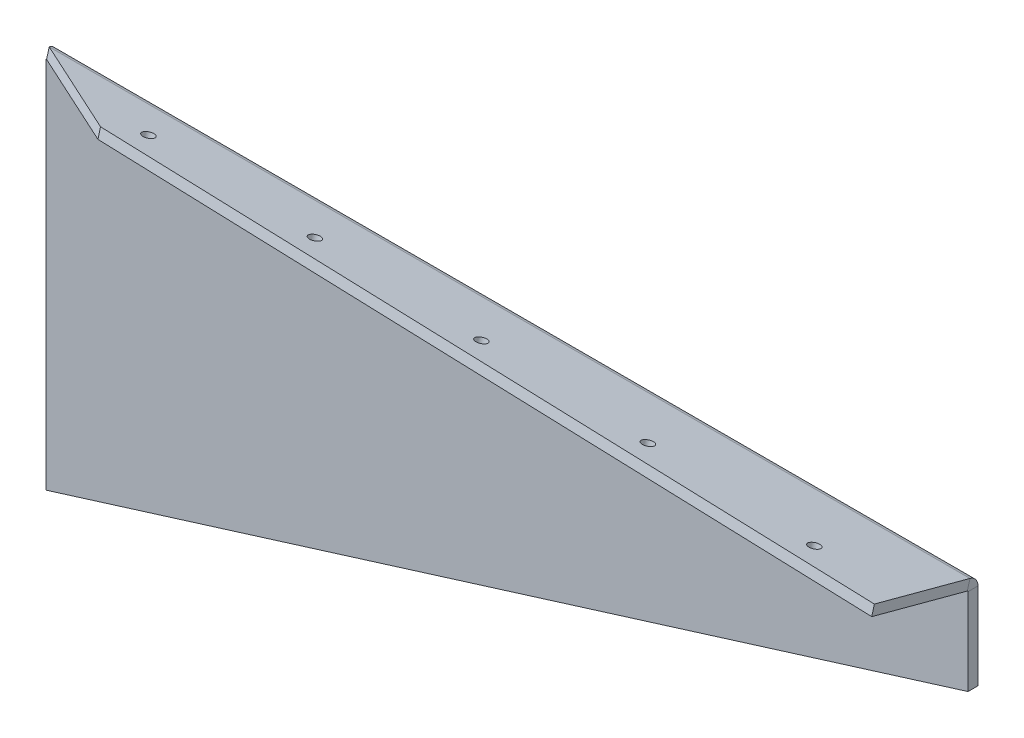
ISO-10303-21;
HEADER;
FILE_DESCRIPTION(('STEP AP214'),'2;1');
FILE_NAME('part.step','',(''),(''),'','','');
FILE_SCHEMA(('AUTOMOTIVE_DESIGN { 1 0 10303 214 1 1 1 1 }'));
ENDSEC;
DATA;
#1=APPLICATION_CONTEXT('core data for automotive mechanical design processes');
#2=APPLICATION_PROTOCOL_DEFINITION('international standard','automotive_design',2000,#1);
#3=PRODUCT_CONTEXT('',#1,'mechanical');
#4=PRODUCT('Part','Part','',(#3));
#5=PRODUCT_RELATED_PRODUCT_CATEGORY('part','',(#4));
#6=PRODUCT_DEFINITION_FORMATION('','',#4);
#7=PRODUCT_DEFINITION_CONTEXT('part definition',#1,'design');
#8=PRODUCT_DEFINITION('design','',#6,#7);
#9=PRODUCT_DEFINITION_SHAPE('','',#8);
#10=(LENGTH_UNIT() NAMED_UNIT(*) SI_UNIT(.MILLI.,.METRE.));
#11=(NAMED_UNIT(*) PLANE_ANGLE_UNIT() SI_UNIT($,.RADIAN.));
#12=(NAMED_UNIT(*) SI_UNIT($,.STERADIAN.) SOLID_ANGLE_UNIT());
#13=UNCERTAINTY_MEASURE_WITH_UNIT(LENGTH_MEASURE(1.E-05),#10,'distance_accuracy_value','');
#14=(GEOMETRIC_REPRESENTATION_CONTEXT(3) GLOBAL_UNCERTAINTY_ASSIGNED_CONTEXT((#13)) GLOBAL_UNIT_ASSIGNED_CONTEXT((#10,
#11,#12)) REPRESENTATION_CONTEXT('',''));
#15=CARTESIAN_POINT('',(0.,0.,0.));
#16=DIRECTION('',(0.,0.,1.));
#17=DIRECTION('',(1.,0.,0.));
#18=AXIS2_PLACEMENT_3D('',#15,#16,#17);
#19=CARTESIAN_POINT('',(0.,-300.,8.));
#20=DIRECTION('',(1.,0.,0.));
#21=DIRECTION('',(0.,0.,-1.));
#22=AXIS2_PLACEMENT_3D('',#19,#20,#21);
#23=PLANE('',#22);
#24=DIRECTION('',(0.,0.,-1.));
#25=VECTOR('',#24,1.);
#26=CARTESIAN_POINT('',(0.,-0.565213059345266,8.00000000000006));
#27=LINE('',#26,#25);
#28=CARTESIAN_POINT('',(0.,-0.565213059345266,8.00000000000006));
#29=VERTEX_POINT('',#28);
#30=CARTESIAN_POINT('',(0.,-0.565213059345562,0.));
#31=VERTEX_POINT('',#30);
#32=EDGE_CURVE('E144',#29,#31,#27,.T.);
#33=ORIENTED_EDGE('',*,*,#32,.T.);
#34=DIRECTION('',(0.,-1.,0.));
#35=VECTOR('',#34,1.);
#36=CARTESIAN_POINT('',(0.,-300.,0.));
#37=LINE('',#36,#35);
#38=CARTESIAN_POINT('',(0.,-300.,0.));
#39=VERTEX_POINT('',#38);
#40=EDGE_CURVE('E149',#31,#39,#37,.T.);
#41=ORIENTED_EDGE('',*,*,#40,.T.);
#42=DIRECTION('',(0.,0.,-1.));
#43=VECTOR('',#42,1.);
#44=CARTESIAN_POINT('',(0.,-300.,8.));
#45=LINE('',#44,#43);
#46=CARTESIAN_POINT('',(0.,-300.,8.));
#47=VERTEX_POINT('',#46);
#48=EDGE_CURVE('E11',#47,#39,#45,.T.);
#49=ORIENTED_EDGE('',*,*,#48,.F.);
#50=DIRECTION('',(0.,-1.,0.));
#51=VECTOR('',#50,1.);
#52=CARTESIAN_POINT('',(0.,-300.,8.));
#53=LINE('',#52,#51);
#54=EDGE_CURVE('E195',#29,#47,#53,.T.);
#55=ORIENTED_EDGE('',*,*,#54,.F.);
#56=EDGE_LOOP('',(#33,#41,#49,#55));
#57=FACE_BOUND('',#56,.T.);
#58=ADVANCED_FACE('F31',(#57),#23,.F.);
#59=CARTESIAN_POINT('',(740.,0.,8.));
#60=DIRECTION('',(-1.,0.,0.));
#61=DIRECTION('',(0.,0.,1.));
#62=AXIS2_PLACEMENT_3D('',#59,#60,#61);
#63=PLANE('',#62);
#64=DIRECTION('',(0.,0.,-1.));
#65=VECTOR('',#64,1.);
#66=CARTESIAN_POINT('',(740.,-0.565213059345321,8.00000000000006));
#67=LINE('',#66,#65);
#68=CARTESIAN_POINT('',(740.,-0.565213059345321,8.00000000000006));
#69=VERTEX_POINT('',#68);
#70=CARTESIAN_POINT('',(740.,-0.565213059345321,0.));
#71=VERTEX_POINT('',#70);
#72=EDGE_CURVE('E147',#69,#71,#67,.T.);
#73=ORIENTED_EDGE('',*,*,#72,.F.);
#74=DIRECTION('',(0.,1.,0.));
#75=VECTOR('',#74,1.);
#76=CARTESIAN_POINT('',(740.,0.,8.));
#77=LINE('',#76,#75);
#78=CARTESIAN_POINT('',(740.,-70.,8.));
#79=VERTEX_POINT('',#78);
#80=EDGE_CURVE('E206',#79,#69,#77,.T.);
#81=ORIENTED_EDGE('',*,*,#80,.F.);
#82=DIRECTION('',(0.,0.,-1.));
#83=VECTOR('',#82,1.);
#84=CARTESIAN_POINT('',(740.,-70.,8.));
#85=LINE('',#84,#83);
#86=CARTESIAN_POINT('',(740.,-70.,0.));
#87=VERTEX_POINT('',#86);
#88=EDGE_CURVE('E38',#79,#87,#85,.T.);
#89=ORIENTED_EDGE('',*,*,#88,.T.);
#90=DIRECTION('',(0.,1.,0.));
#91=VECTOR('',#90,1.);
#92=CARTESIAN_POINT('',(740.,0.,0.));
#93=LINE('',#92,#91);
#94=EDGE_CURVE('E200',#87,#71,#93,.T.);
#95=ORIENTED_EDGE('',*,*,#94,.T.);
#96=EDGE_LOOP('',(#73,#81,#89,#95));
#97=FACE_BOUND('',#96,.T.);
#98=ADVANCED_FACE('F183',(#97),#63,.F.);
#99=CARTESIAN_POINT('',(0.,0.,8.));
#100=DIRECTION('',(0.,0.,-1.));
#101=DIRECTION('',(-1.,0.,0.));
#102=AXIS2_PLACEMENT_3D('',#99,#100,#101);
#103=PLANE('',#102);
#104=DIRECTION('',(-1.,0.,0.));
#105=VECTOR('',#104,1.);
#106=CARTESIAN_POINT('',(0.,-0.565213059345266,8.00000000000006));
#107=LINE('',#106,#105);
#108=EDGE_CURVE('E142',#29,#69,#107,.F.);
#109=ORIENTED_EDGE('',*,*,#108,.F.);
#110=ORIENTED_EDGE('',*,*,#54,.T.);
#111=DIRECTION('',(0.954938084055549,0.296805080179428,0.));
#112=VECTOR('',#111,1.);
#113=CARTESIAN_POINT('',(740.,-70.,8.));
#114=LINE('',#113,#112);
#115=EDGE_CURVE('E53',#47,#79,#114,.T.);
#116=ORIENTED_EDGE('',*,*,#115,.T.);
#117=ORIENTED_EDGE('',*,*,#80,.T.);
#118=EDGE_LOOP('',(#109,#110,#116,#117));
#119=FACE_BOUND('',#118,.T.);
#120=ADVANCED_FACE('F188',(#119),#103,.F.);
#121=CARTESIAN_POINT('',(0.,0.,0.));
#122=DIRECTION('',(0.,0.,-1.));
#123=DIRECTION('',(-1.,0.,0.));
#124=AXIS2_PLACEMENT_3D('',#121,#122,#123);
#125=PLANE('',#124);
#126=ORIENTED_EDGE('',*,*,#40,.F.);
#127=DIRECTION('',(-1.,0.,0.));
#128=VECTOR('',#127,1.);
#129=CARTESIAN_POINT('',(0.,-0.565213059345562,0.));
#130=LINE('',#129,#128);
#131=EDGE_CURVE('E100',#31,#71,#130,.F.);
#132=ORIENTED_EDGE('',*,*,#131,.T.);
#133=ORIENTED_EDGE('',*,*,#94,.F.);
#134=DIRECTION('',(0.954938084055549,0.296805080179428,0.));
#135=VECTOR('',#134,1.);
#136=CARTESIAN_POINT('',(740.,-70.,0.));
#137=LINE('',#136,#135);
#138=EDGE_CURVE('E199',#39,#87,#137,.T.);
#139=ORIENTED_EDGE('',*,*,#138,.F.);
#140=EDGE_LOOP('',(#126,#132,#133,#139));
#141=FACE_BOUND('',#140,.T.);
#142=ADVANCED_FACE('F180',(#141),#125,.T.);
#143=CARTESIAN_POINT('',(740.,-70.,8.));
#144=DIRECTION('',(-0.296805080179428,0.95493808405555,0.));
#145=DIRECTION('',(-0.95493808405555,-0.296805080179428,0.));
#146=AXIS2_PLACEMENT_3D('',#143,#144,#145);
#147=PLANE('',#146);
#148=ORIENTED_EDGE('',*,*,#138,.T.);
#149=ORIENTED_EDGE('',*,*,#88,.F.);
#150=ORIENTED_EDGE('',*,*,#115,.F.);
#151=ORIENTED_EDGE('',*,*,#48,.T.);
#152=EDGE_LOOP('',(#148,#149,#150,#151));
#153=FACE_BOUND('',#152,.T.);
#154=ADVANCED_FACE('F173',(#153),#147,.F.);
#155=CARTESIAN_POINT('',(740.,-0.565213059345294,8.73660000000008));
#156=DIRECTION('',(1.,0.,0.));
#157=DIRECTION('',(0.,1.,0.));
#158=AXIS2_PLACEMENT_3D('',#155,#156,#157);
#159=PLANE('',#158);
#160=DIRECTION('',(0.,0.965925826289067,-0.258819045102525));
#161=VECTOR('',#160,1.);
#162=CARTESIAN_POINT('',(740.,0.146287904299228,8.54595389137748));
#163=LINE('',#162,#161);
#164=CARTESIAN_POINT('',(740.,0.146287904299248,8.54595389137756));
#165=VERTEX_POINT('',#164);
#166=CARTESIAN_POINT('',(740.,7.87369451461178,6.47540153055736));
#167=VERTEX_POINT('',#166);
#168=EDGE_CURVE('E215',#165,#167,#163,.T.);
#169=ORIENTED_EDGE('',*,*,#168,.F.);
#170=CARTESIAN_POINT('',(740.,-0.565213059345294,8.73660000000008));
#171=DIRECTION('',(-1.,0.,0.));
#172=DIRECTION('',(0.,-1.,0.));
#173=AXIS2_PLACEMENT_3D('',#170,#171,#172);
#174=CIRCLE('',#173,0.736600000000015);
#175=EDGE_CURVE('E103',#69,#165,#174,.F.);
#176=ORIENTED_EDGE('',*,*,#175,.F.);
#177=ORIENTED_EDGE('',*,*,#72,.T.);
#178=CARTESIAN_POINT('',(740.,-0.565213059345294,8.73660000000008));
#179=DIRECTION('',(-1.,0.,0.));
#180=DIRECTION('',(0.,-1.,0.));
#181=AXIS2_PLACEMENT_3D('',#178,#179,#180);
#182=CIRCLE('',#181,8.73660000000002);
#183=EDGE_CURVE('E45',#71,#167,#182,.F.);
#184=ORIENTED_EDGE('',*,*,#183,.T.);
#185=EDGE_LOOP('',(#169,#176,#177,#184));
#186=FACE_BOUND('',#185,.T.);
#187=ADVANCED_FACE('F169',(#186),#159,.T.);
#188=CARTESIAN_POINT('',(1.01738350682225,7.95096858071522,6.45469600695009));
#189=CARTESIAN_POINT('',(0.847588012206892,7.45245769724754,4.59422806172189));
#190=CARTESIAN_POINT('',(0.678255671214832,6.32799520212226,2.91286364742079));
#191=CARTESIAN_POINT('',(0.339127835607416,3.27599070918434,0.570978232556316));
#192=CARTESIAN_POINT('',(0.169795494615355,1.36088508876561,-0.080000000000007));
#193=CARTESIAN_POINT('',(0.,-0.565213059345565,-0.0799999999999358));
#194=CARTESIAN_POINT('',(1.01738350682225,7.87369451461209,6.47540153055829));
#195=CARTESIAN_POINT('',(0.847589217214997,7.37970730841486,4.63181617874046));
#196=CARTESIAN_POINT('',(0.678255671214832,6.26544765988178,2.96570702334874));
#197=CARTESIAN_POINT('',(0.339127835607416,3.24113642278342,0.645071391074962));
#198=CARTESIAN_POINT('',(0.16979428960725,1.34340694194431,0.));
#199=CARTESIAN_POINT('',(0.,-0.565213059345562,0.));
#200=CARTESIAN_POINT('',(1.01738350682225,0.146287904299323,8.54595389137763));
#201=CARTESIAN_POINT('',(0.847709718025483,0.104668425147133,8.39062788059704));
#202=CARTESIAN_POINT('',(0.678255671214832,0.0106934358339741,8.25004461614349));
#203=CARTESIAN_POINT('',(0.339127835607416,-0.244292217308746,8.05438724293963));
#204=CARTESIAN_POINT('',(0.169673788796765,-0.404407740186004,8.00000000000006));
#205=CARTESIAN_POINT('',(0.,-0.565213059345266,8.00000000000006));
#206=CARTESIAN_POINT('',(1.01738350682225,0.0682410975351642,8.56686647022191));
#207=CARTESIAN_POINT('',(0.847710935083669,0.031190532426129,8.42859187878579));
#208=CARTESIAN_POINT('',(0.678255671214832,-0.0524795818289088,8.30341642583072));
#209=CARTESIAN_POINT('',(0.339127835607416,-0.279495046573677,8.12922133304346));
#210=CARTESIAN_POINT('',(0.169672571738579,-0.42206066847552,8.08080000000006));
#211=CARTESIAN_POINT('',(0.,-0.565213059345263,8.08080000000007));
#212=B_SPLINE_SURFACE_WITH_KNOTS('',1,3,((#188,#189,#190,#191,#192,#193),(#194,#195,#196,#197,
#198,#199),(#200,#201,#202,#203,#204,#205),(#206,#207,#208,#209,#210,#211)),.UNSPECIFIED.,.F.,
.F.,.F.,(2,1,1,2),(4,2,4),(-0.01,0.,1.,1.0101),(0.,0.5,1.),.UNSPECIFIED.);
#213=CARTESIAN_POINT('',(1.01738350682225,0.146287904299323,8.54595389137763));
#214=CARTESIAN_POINT('',(0.985529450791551,0.138484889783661,8.51679799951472));
#215=CARTESIAN_POINT('',(0.953676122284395,0.128873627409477,8.48812956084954));
#216=CARTESIAN_POINT('',(0.889975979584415,0.106215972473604,8.43218250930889));
#217=CARTESIAN_POINT('',(0.858129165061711,0.0931698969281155,8.40490376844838));
#218=CARTESIAN_POINT('',(0.794500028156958,0.0638495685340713,8.3521942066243));
#219=CARTESIAN_POINT('',(0.76271769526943,0.047581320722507,8.32676006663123));
#220=CARTESIAN_POINT('',(0.69915845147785,0.0120652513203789,8.27808215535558));
#221=CARTESIAN_POINT('',(0.667381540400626,-0.00718244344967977,8.25483829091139));
#222=CARTESIAN_POINT('',(0.571839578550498,-0.0691121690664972,8.18878319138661));
#223=CARTESIAN_POINT('',(0.50801830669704,-0.115906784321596,8.14978055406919));
#224=CARTESIAN_POINT('',(0.380468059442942,-0.217557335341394,8.08439974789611));
#225=CARTESIAN_POINT('',(0.316739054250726,-0.272405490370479,8.05800949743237));
#226=CARTESIAN_POINT('',(0.210869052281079,-0.367490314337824,8.02590586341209));
#227=CARTESIAN_POINT('',(0.168706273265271,-0.406405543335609,8.01621938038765));
#228=CARTESIAN_POINT('',(0.0843707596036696,-0.485281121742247,8.00325378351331));
#229=CARTESIAN_POINT('',(0.0421980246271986,-0.525241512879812,7.99997492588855));
#230=CARTESIAN_POINT('',(0.,-0.565213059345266,8.00000000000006));
#231=B_SPLINE_CURVE_WITH_KNOTS('',3,(#213,#214,#215,#216,#217,#218,#219,#220,#221,#222,#223,
#224,#225,#226,#227,#228,#229,#230),.UNSPECIFIED.,.F.,.F.,(4,2,2,2,2,2,2,2,4),(0.,
0.131602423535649,0.263192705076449,0.394540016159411,0.525881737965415,0.789206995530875,
1.05227950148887,1.22650322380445,1.4007339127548),.UNSPECIFIED.);
#232=CARTESIAN_POINT('',(1.01738350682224,0.146287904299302,8.54595389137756));
#233=VERTEX_POINT('',#232);
#234=EDGE_CURVE('E110',#233,#29,#231,.T.);
#235=DIRECTION('',(0.,0.965925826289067,-0.258819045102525));
#236=VECTOR('',#235,1.);
#237=CARTESIAN_POINT('',(1.01738350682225,0.146287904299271,8.54595389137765));
#238=LINE('',#237,#236);
#239=CARTESIAN_POINT('',(1.01738350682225,7.87369451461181,6.47540153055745));
#240=VERTEX_POINT('',#239);
#241=EDGE_CURVE('E107',#233,#240,#238,.T.);
#242=CARTESIAN_POINT('',(1.01738350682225,7.87369451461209,6.47540153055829));
#243=CARTESIAN_POINT('',(0.995436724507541,7.80987577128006,6.23712327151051));
#244=CARTESIAN_POINT('',(0.973485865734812,7.73591614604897,6.00156665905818));
#245=CARTESIAN_POINT('',(0.929585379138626,7.56836020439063,5.53755607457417));
#246=CARTESIAN_POINT('',(0.907635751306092,7.47476481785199,5.30910176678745));
#247=CARTESIAN_POINT('',(0.863755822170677,7.2686269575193,4.86104245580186));
#248=CARTESIAN_POINT('',(0.841825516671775,7.15609382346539,4.6414331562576));
#249=CARTESIAN_POINT('',(0.797970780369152,6.91286392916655,4.2125181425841));
#250=CARTESIAN_POINT('',(0.776046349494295,6.78216739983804,4.00321229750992));
#251=CARTESIAN_POINT('',(0.732187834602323,6.50348595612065,3.59631711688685));
#252=CARTESIAN_POINT('',(0.710253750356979,6.35549388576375,3.39873268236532));
#253=CARTESIAN_POINT('',(0.666379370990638,6.04332448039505,3.01678845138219));
#254=CARTESIAN_POINT('',(0.644439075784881,5.87914691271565,2.83242884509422));
#255=CARTESIAN_POINT('',(0.600556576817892,5.5358389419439,2.47831430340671));
#256=CARTESIAN_POINT('',(0.57861437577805,5.35671321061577,2.30855483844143));
#257=CARTESIAN_POINT('',(0.534736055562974,4.98474917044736,1.98479339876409));
#258=CARTESIAN_POINT('',(0.512799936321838,4.79191101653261,1.8307912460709));
#259=CARTESIAN_POINT('',(0.468925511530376,4.39393367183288,1.5396687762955));
#260=CARTESIAN_POINT('',(0.44698720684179,4.1887963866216,1.40254585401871));
#261=CARTESIAN_POINT('',(0.403105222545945,3.7675682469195,1.14607870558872));
#262=CARTESIAN_POINT('',(0.381161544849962,3.55147259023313,1.02674236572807));
#263=CARTESIAN_POINT('',(0.337278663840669,3.10992751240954,0.806759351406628));
#264=CARTESIAN_POINT('',(0.315339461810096,2.88447659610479,0.706115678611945));
#265=CARTESIAN_POINT('',(0.271474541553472,2.42597302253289,0.524306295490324));
#266=CARTESIAN_POINT('',(0.249548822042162,2.19292419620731,0.443130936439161));
#267=CARTESIAN_POINT('',(0.208654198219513,1.75266352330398,0.31038295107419));
#268=CARTESIAN_POINT('',(0.189685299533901,1.54620573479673,0.256294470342));
#269=CARTESIAN_POINT('',(0.151743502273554,1.12990112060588,0.163371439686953));
#270=CARTESIAN_POINT('',(0.132770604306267,0.920054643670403,0.124535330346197));
#271=CARTESIAN_POINT('',(0.094831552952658,0.498221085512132,0.0623453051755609));
#272=CARTESIAN_POINT('',(0.0758654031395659,0.286235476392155,0.0389813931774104));
#273=CARTESIAN_POINT('',(0.0379316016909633,-0.138903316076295,0.00780038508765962));
#274=CARTESIAN_POINT('',(0.0189639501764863,-0.352056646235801,-1.47089662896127E-05));
#275=CARTESIAN_POINT('',(0.,-0.565213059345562,0.));
#276=B_SPLINE_CURVE_WITH_KNOTS('',3,(#242,#243,#244,#245,#246,#247,#248,#249,#250,#251,#252,
#253,#254,#255,#256,#257,#258,#259,#260,#261,#262,#263,#264,#265,#266,#267,#268,#269,#270,#271,
#272,#273,#274,#275),.UNSPECIFIED.,.F.,.F.,(4,2,2,2,2,2,2,2,2,2,2,2,2,2,2,2,4),(0.,
0.74272618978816,1.48541721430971,2.22774302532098,2.97005939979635,3.71268399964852,
4.45531927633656,5.19772331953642,5.94011897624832,6.68239990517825,7.42500897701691,
8.16773719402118,8.91009654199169,9.55234285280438,10.1945234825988,10.8362888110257,
11.4781367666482),.UNSPECIFIED.);
#277=EDGE_CURVE('E94',#240,#31,#276,.T.);
#278=ORIENTED_EDGE('',*,*,#234,.F.);
#279=ORIENTED_EDGE('',*,*,#241,.T.);
#280=ORIENTED_EDGE('',*,*,#277,.T.);
#281=ORIENTED_EDGE('',*,*,#32,.F.);
#282=EDGE_LOOP('',(#278,#279,#280,#281));
#283=FACE_BOUND('',#282,.T.);
#284=ADVANCED_FACE('F108',(#283),#212,.F.);
#285=CARTESIAN_POINT('',(0.,-0.565213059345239,8.73660000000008));
#286=DIRECTION('',(-1.,0.,0.));
#287=DIRECTION('',(0.,0.965925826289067,-0.258819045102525));
#288=AXIS2_PLACEMENT_3D('',#285,#286,#287);
#289=CYLINDRICAL_SURFACE('',#288,8.73660000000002);
#290=ORIENTED_EDGE('',*,*,#131,.F.);
#291=ORIENTED_EDGE('',*,*,#277,.F.);
#292=DIRECTION('',(1.,0.,0.));
#293=VECTOR('',#292,1.);
#294=CARTESIAN_POINT('',(740.,7.87369451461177,6.47540153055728));
#295=LINE('',#294,#293);
#296=EDGE_CURVE('E98',#240,#167,#295,.T.);
#297=ORIENTED_EDGE('',*,*,#296,.T.);
#298=ORIENTED_EDGE('',*,*,#183,.F.);
#299=EDGE_LOOP('',(#290,#291,#297,#298));
#300=FACE_BOUND('',#299,.T.);
#301=ADVANCED_FACE('F96',(#300),#289,.T.);
#302=CARTESIAN_POINT('',(0.,-0.565213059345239,8.73660000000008));
#303=DIRECTION('',(-1.,0.,0.));
#304=DIRECTION('',(0.,0.965925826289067,-0.258819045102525));
#305=AXIS2_PLACEMENT_3D('',#302,#303,#304);
#306=CYLINDRICAL_SURFACE('',#305,0.736600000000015);
#307=ORIENTED_EDGE('',*,*,#108,.T.);
#308=ORIENTED_EDGE('',*,*,#175,.T.);
#309=DIRECTION('',(-1.,0.,0.));
#310=VECTOR('',#309,1.);
#311=CARTESIAN_POINT('',(740.,0.146287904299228,8.54595389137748));
#312=LINE('',#311,#310);
#313=EDGE_CURVE('E114',#165,#233,#312,.T.);
#314=ORIENTED_EDGE('',*,*,#313,.T.);
#315=ORIENTED_EDGE('',*,*,#234,.T.);
#316=EDGE_LOOP('',(#307,#308,#314,#315));
#317=FACE_BOUND('',#316,.T.);
#318=ADVANCED_FACE('F168',(#317),#306,.F.);
#319=CARTESIAN_POINT('',(740.,7.72740661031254,5.9294476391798));
#320=DIRECTION('',(-1.,0.,0.));
#321=DIRECTION('',(0.,0.,1.));
#322=AXIS2_PLACEMENT_3D('',#319,#320,#321);
#323=PLANE('',#322);
#324=ORIENTED_EDGE('',*,*,#168,.T.);
#325=DIRECTION('',(0.,-0.258819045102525,-0.965925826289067));
#326=VECTOR('',#325,1.);
#327=CARTESIAN_POINT('',(740.,7.72740661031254,5.9294476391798));
#328=LINE('',#327,#326);
#329=CARTESIAN_POINT('',(740.,28.4329302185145,83.2035137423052));
#330=VERTEX_POINT('',#329);
#331=EDGE_CURVE('E122',#330,#167,#328,.T.);
#332=ORIENTED_EDGE('',*,*,#331,.F.);
#333=DIRECTION('',(0.,-0.965925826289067,0.258819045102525));
#334=VECTOR('',#333,1.);
#335=CARTESIAN_POINT('',(740.,28.4329302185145,83.2035137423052));
#336=LINE('',#335,#334);
#337=CARTESIAN_POINT('',(740.,20.705523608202,85.2740661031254));
#338=VERTEX_POINT('',#337);
#339=EDGE_CURVE('E131',#330,#338,#336,.T.);
#340=ORIENTED_EDGE('',*,*,#339,.T.);
#341=DIRECTION('',(0.,-0.258819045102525,-0.965925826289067));
#342=VECTOR('',#341,1.);
#343=CARTESIAN_POINT('',(740.,0.,8.));
#344=LINE('',#343,#342);
#345=EDGE_CURVE('E123',#338,#165,#344,.T.);
#346=ORIENTED_EDGE('',*,*,#345,.T.);
#347=EDGE_LOOP('',(#324,#332,#340,#346));
#348=FACE_BOUND('',#347,.T.);
#349=ADVANCED_FACE('F233',(#348),#323,.F.);
#350=CARTESIAN_POINT('',(90.,20.6683588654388,54.2257389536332));
#351=DIRECTION('',(0.485642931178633,-0.2262485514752,-0.844371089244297));
#352=DIRECTION('',(-0.866848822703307,0.,-0.498571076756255));
#353=AXIS2_PLACEMENT_3D('',#350,#351,#352);
#354=PLANE('',#353);
#355=ORIENTED_EDGE('',*,*,#241,.F.);
#356=DIRECTION('',(0.874157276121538,0.125693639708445,0.469095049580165));
#357=VECTOR('',#356,1.);
#358=CARTESIAN_POINT('',(90.,12.9409522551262,56.2962913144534));
#359=LINE('',#358,#357);
#360=CARTESIAN_POINT('',(90.,12.9409522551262,56.2962913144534));
#361=VERTEX_POINT('',#360);
#362=EDGE_CURVE('E226',#233,#361,#359,.T.);
#363=ORIENTED_EDGE('',*,*,#362,.T.);
#364=DIRECTION('',(0.,-0.965925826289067,0.258819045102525));
#365=VECTOR('',#364,1.);
#366=CARTESIAN_POINT('',(90.,20.6683588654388,54.2257389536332));
#367=LINE('',#366,#365);
#368=CARTESIAN_POINT('',(90.,20.6683588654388,54.2257389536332));
#369=VERTEX_POINT('',#368);
#370=EDGE_CURVE('E127',#369,#361,#367,.T.);
#371=ORIENTED_EDGE('',*,*,#370,.F.);
#372=DIRECTION('',(0.874157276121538,0.125693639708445,0.469095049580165));
#373=VECTOR('',#372,1.);
#374=CARTESIAN_POINT('',(90.,20.6683588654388,54.2257389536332));
#375=LINE('',#374,#373);
#376=EDGE_CURVE('E119',#240,#369,#375,.T.);
#377=ORIENTED_EDGE('',*,*,#376,.F.);
#378=EDGE_LOOP('',(#355,#363,#371,#377));
#379=FACE_BOUND('',#378,.T.);
#380=ADVANCED_FACE('F125',(#379),#354,.F.);
#381=CARTESIAN_POINT('',(740.,7.72740661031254,5.9294476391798));
#382=DIRECTION('',(0.,-0.965925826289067,0.258819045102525));
#383=DIRECTION('',(0.,-0.258819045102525,-0.965925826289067));
#384=AXIS2_PLACEMENT_3D('',#381,#382,#383);
#385=PLANE('',#384);
#386=CARTESIAN_POINT('',(669.404501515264,22.4077408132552,60.7172007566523));
#387=DIRECTION('',(0.,-0.965925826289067,0.258819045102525));
#388=DIRECTION('',(0.,-0.258819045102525,-0.965925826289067));
#389=AXIS2_PLACEMENT_3D('',#386,#387,#388);
#390=CIRCLE('',#389,4.50000000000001);
#391=CARTESIAN_POINT('',(669.404501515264,21.2430551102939,56.3705345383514));
#392=VERTEX_POINT('',#391);
#393=EDGE_CURVE('E382',#392,#392,#390,.T.);
#394=ORIENTED_EDGE('',*,*,#393,.T.);
#395=EDGE_LOOP('',(#394));
#396=FACE_BOUND('',#395,.T.);
#397=CARTESIAN_POINT('',(529.553376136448,20.7371499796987,54.4824708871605));
#398=DIRECTION('',(0.,-0.965925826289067,0.258819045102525));
#399=DIRECTION('',(0.,-0.258819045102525,-0.965925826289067));
#400=AXIS2_PLACEMENT_3D('',#397,#398,#399);
#401=CIRCLE('',#400,4.50000000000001);
#402=CARTESIAN_POINT('',(529.553376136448,19.5724642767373,50.1358046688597));
#403=VERTEX_POINT('',#402);
#404=EDGE_CURVE('E386',#403,#403,#401,.T.);
#405=ORIENTED_EDGE('',*,*,#404,.T.);
#406=EDGE_LOOP('',(#405));
#407=FACE_BOUND('',#406,.T.);
#408=CARTESIAN_POINT('',(389.702250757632,19.0665591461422,48.2477410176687));
#409=DIRECTION('',(0.,-0.965925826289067,0.258819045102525));
#410=DIRECTION('',(0.,-0.258819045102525,-0.965925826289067));
#411=AXIS2_PLACEMENT_3D('',#408,#409,#410);
#412=CIRCLE('',#411,4.50000000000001);
#413=CARTESIAN_POINT('',(389.702250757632,17.9018734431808,43.9010747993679));
#414=VERTEX_POINT('',#413);
#415=EDGE_CURVE('E395',#414,#414,#412,.T.);
#416=ORIENTED_EDGE('',*,*,#415,.T.);
#417=EDGE_LOOP('',(#416));
#418=FACE_BOUND('',#417,.T.);
#419=CARTESIAN_POINT('',(249.851125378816,17.3959683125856,42.0130111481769));
#420=DIRECTION('',(0.,-0.965925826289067,0.258819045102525));
#421=DIRECTION('',(0.,-0.258819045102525,-0.965925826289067));
#422=AXIS2_PLACEMENT_3D('',#419,#420,#421);
#423=CIRCLE('',#422,4.50000000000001);
#424=CARTESIAN_POINT('',(249.851125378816,16.2312826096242,37.6663449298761));
#425=VERTEX_POINT('',#424);
#426=EDGE_CURVE('E401',#425,#425,#423,.T.);
#427=ORIENTED_EDGE('',*,*,#426,.T.);
#428=EDGE_LOOP('',(#427));
#429=FACE_BOUND('',#428,.T.);
#430=CARTESIAN_POINT('',(110.,15.7253774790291,35.7782812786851));
#431=DIRECTION('',(0.,-0.965925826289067,0.258819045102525));
#432=DIRECTION('',(0.,-0.258819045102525,-0.965925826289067));
#433=AXIS2_PLACEMENT_3D('',#430,#431,#432);
#434=CIRCLE('',#433,4.50000000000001);
#435=CARTESIAN_POINT('',(110.,14.5606917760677,31.4316150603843));
#436=VERTEX_POINT('',#435);
#437=EDGE_CURVE('E218',#436,#436,#434,.T.);
#438=ORIENTED_EDGE('',*,*,#437,.T.);
#439=EDGE_LOOP('',(#438));
#440=FACE_BOUND('',#439,.T.);
#441=ORIENTED_EDGE('',*,*,#296,.F.);
#442=ORIENTED_EDGE('',*,*,#376,.T.);
#443=DIRECTION('',(0.998936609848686,0.0119327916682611,0.0445337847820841));
#444=VECTOR('',#443,1.);
#445=CARTESIAN_POINT('',(740.,28.4329302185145,83.2035137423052));
#446=LINE('',#445,#444);
#447=EDGE_CURVE('E129',#369,#330,#446,.T.);
#448=ORIENTED_EDGE('',*,*,#447,.T.);
#449=ORIENTED_EDGE('',*,*,#331,.T.);
#450=EDGE_LOOP('',(#441,#442,#448,#449));
#451=FACE_BOUND('',#450,.T.);
#452=ADVANCED_FACE('F118',(#396,#407,#418,#429,#440,#451),#385,.F.);
#453=CARTESIAN_POINT('',(740.,0.,8.));
#454=DIRECTION('',(0.,-0.965925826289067,0.258819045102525));
#455=DIRECTION('',(0.,-0.258819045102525,-0.965925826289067));
#456=AXIS2_PLACEMENT_3D('',#453,#454,#455);
#457=PLANE('',#456);
#458=CARTESIAN_POINT('',(669.404501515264,14.6803342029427,62.7877531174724));
#459=DIRECTION('',(0.,-0.965925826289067,0.258819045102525));
#460=DIRECTION('',(0.,-0.258819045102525,-0.965925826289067));
#461=AXIS2_PLACEMENT_3D('',#458,#459,#460);
#462=CIRCLE('',#461,4.50000000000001);
#463=CARTESIAN_POINT('',(669.404501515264,13.5156484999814,58.4410868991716));
#464=VERTEX_POINT('',#463);
#465=EDGE_CURVE('E379',#464,#464,#462,.T.);
#466=ORIENTED_EDGE('',*,*,#465,.F.);
#467=EDGE_LOOP('',(#466));
#468=FACE_BOUND('',#467,.T.);
#469=CARTESIAN_POINT('',(529.553376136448,13.0097433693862,56.5530232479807));
#470=DIRECTION('',(0.,-0.965925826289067,0.258819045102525));
#471=DIRECTION('',(0.,-0.258819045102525,-0.965925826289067));
#472=AXIS2_PLACEMENT_3D('',#469,#470,#471);
#473=CIRCLE('',#472,4.50000000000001);
#474=CARTESIAN_POINT('',(529.553376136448,11.8450576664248,52.2063570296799));
#475=VERTEX_POINT('',#474);
#476=EDGE_CURVE('E383',#475,#475,#473,.T.);
#477=ORIENTED_EDGE('',*,*,#476,.F.);
#478=EDGE_LOOP('',(#477));
#479=FACE_BOUND('',#478,.T.);
#480=CARTESIAN_POINT('',(389.702250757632,11.3391525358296,50.3182933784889));
#481=DIRECTION('',(0.,-0.965925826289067,0.258819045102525));
#482=DIRECTION('',(0.,-0.258819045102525,-0.965925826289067));
#483=AXIS2_PLACEMENT_3D('',#480,#481,#482);
#484=CIRCLE('',#483,4.50000000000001);
#485=CARTESIAN_POINT('',(389.702250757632,10.1744668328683,45.9716271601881));
#486=VERTEX_POINT('',#485);
#487=EDGE_CURVE('E392',#486,#486,#484,.T.);
#488=ORIENTED_EDGE('',*,*,#487,.F.);
#489=EDGE_LOOP('',(#488));
#490=FACE_BOUND('',#489,.T.);
#491=CARTESIAN_POINT('',(249.851125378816,9.66856170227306,44.0835635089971));
#492=DIRECTION('',(0.,-0.965925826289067,0.258819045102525));
#493=DIRECTION('',(0.,-0.258819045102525,-0.965925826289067));
#494=AXIS2_PLACEMENT_3D('',#491,#492,#493);
#495=CIRCLE('',#494,4.50000000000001);
#496=CARTESIAN_POINT('',(249.851125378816,8.5038759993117,39.7368972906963));
#497=VERTEX_POINT('',#496);
#498=EDGE_CURVE('E398',#497,#497,#495,.T.);
#499=ORIENTED_EDGE('',*,*,#498,.F.);
#500=EDGE_LOOP('',(#499));
#501=FACE_BOUND('',#500,.T.);
#502=CARTESIAN_POINT('',(110.,7.99797086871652,37.8488336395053));
#503=DIRECTION('',(0.,-0.965925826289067,0.258819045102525));
#504=DIRECTION('',(0.,-0.258819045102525,-0.965925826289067));
#505=AXIS2_PLACEMENT_3D('',#502,#503,#504);
#506=CIRCLE('',#505,4.50000000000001);
#507=CARTESIAN_POINT('',(110.,6.83328516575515,33.5021674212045));
#508=VERTEX_POINT('',#507);
#509=EDGE_CURVE('E222',#508,#508,#506,.T.);
#510=ORIENTED_EDGE('',*,*,#509,.F.);
#511=EDGE_LOOP('',(#510));
#512=FACE_BOUND('',#511,.T.);
#513=ORIENTED_EDGE('',*,*,#362,.F.);
#514=ORIENTED_EDGE('',*,*,#313,.F.);
#515=ORIENTED_EDGE('',*,*,#345,.F.);
#516=DIRECTION('',(0.998936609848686,0.0119327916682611,0.0445337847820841));
#517=VECTOR('',#516,1.);
#518=CARTESIAN_POINT('',(740.,20.705523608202,85.2740661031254));
#519=LINE('',#518,#517);
#520=EDGE_CURVE('E133',#361,#338,#519,.T.);
#521=ORIENTED_EDGE('',*,*,#520,.F.);
#522=EDGE_LOOP('',(#513,#514,#515,#521));
#523=FACE_BOUND('',#522,.T.);
#524=ADVANCED_FACE('F234',(#468,#479,#490,#501,#512,#523),#457,.T.);
#525=CARTESIAN_POINT('',(740.,28.4329302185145,83.2035137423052));
#526=DIRECTION('',(0.0461047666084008,-0.25854381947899,-0.964898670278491));
#527=DIRECTION('',(0.,0.965925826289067,-0.258819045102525));
#528=AXIS2_PLACEMENT_3D('',#525,#526,#527);
#529=PLANE('',#528);
#530=ORIENTED_EDGE('',*,*,#520,.T.);
#531=ORIENTED_EDGE('',*,*,#339,.F.);
#532=ORIENTED_EDGE('',*,*,#447,.F.);
#533=ORIENTED_EDGE('',*,*,#370,.T.);
#534=EDGE_LOOP('',(#530,#531,#532,#533));
#535=FACE_BOUND('',#534,.T.);
#536=ADVANCED_FACE('F230',(#535),#529,.F.);
#537=CARTESIAN_POINT('',(110.,17.6572291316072,35.2606431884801));
#538=DIRECTION('',(0.,-0.965925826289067,0.258819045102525));
#539=DIRECTION('',(0.,-0.258819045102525,-0.965925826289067));
#540=AXIS2_PLACEMENT_3D('',#537,#538,#539);
#541=CYLINDRICAL_SURFACE('',#540,4.50000000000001);
#542=ORIENTED_EDGE('',*,*,#509,.T.);
#543=EDGE_LOOP('',(#542));
#544=FACE_BOUND('',#543,.T.);
#545=ORIENTED_EDGE('',*,*,#437,.F.);
#546=EDGE_LOOP('',(#545));
#547=FACE_BOUND('',#546,.T.);
#548=ADVANCED_FACE('F243',(#544,#547),#541,.F.);
#549=CARTESIAN_POINT('',(249.851125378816,19.3278199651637,41.4953730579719));
#550=DIRECTION('',(0.,-0.965925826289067,0.258819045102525));
#551=DIRECTION('',(0.,-0.258819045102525,-0.965925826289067));
#552=AXIS2_PLACEMENT_3D('',#549,#550,#551);
#553=CYLINDRICAL_SURFACE('',#552,4.50000000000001);
#554=ORIENTED_EDGE('',*,*,#498,.T.);
#555=EDGE_LOOP('',(#554));
#556=FACE_BOUND('',#555,.T.);
#557=ORIENTED_EDGE('',*,*,#426,.F.);
#558=EDGE_LOOP('',(#557));
#559=FACE_BOUND('',#558,.T.);
#560=ADVANCED_FACE('F337',(#556,#559),#553,.F.);
#561=CARTESIAN_POINT('',(389.702250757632,20.9984107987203,47.7301029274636));
#562=DIRECTION('',(0.,-0.965925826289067,0.258819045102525));
#563=DIRECTION('',(0.,-0.258819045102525,-0.965925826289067));
#564=AXIS2_PLACEMENT_3D('',#561,#562,#563);
#565=CYLINDRICAL_SURFACE('',#564,4.50000000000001);
#566=ORIENTED_EDGE('',*,*,#487,.T.);
#567=EDGE_LOOP('',(#566));
#568=FACE_BOUND('',#567,.T.);
#569=ORIENTED_EDGE('',*,*,#415,.F.);
#570=EDGE_LOOP('',(#569));
#571=FACE_BOUND('',#570,.T.);
#572=ADVANCED_FACE('F344',(#568,#571),#565,.F.);
#573=CARTESIAN_POINT('',(529.553376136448,22.6690016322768,53.9648327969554));
#574=DIRECTION('',(0.,-0.965925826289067,0.258819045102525));
#575=DIRECTION('',(0.,-0.258819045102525,-0.965925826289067));
#576=AXIS2_PLACEMENT_3D('',#573,#574,#575);
#577=CYLINDRICAL_SURFACE('',#576,4.50000000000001);
#578=ORIENTED_EDGE('',*,*,#476,.T.);
#579=EDGE_LOOP('',(#578));
#580=FACE_BOUND('',#579,.T.);
#581=ORIENTED_EDGE('',*,*,#404,.F.);
#582=EDGE_LOOP('',(#581));
#583=FACE_BOUND('',#582,.T.);
#584=ADVANCED_FACE('F352',(#580,#583),#577,.F.);
#585=CARTESIAN_POINT('',(669.404501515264,24.3395924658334,60.1995626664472));
#586=DIRECTION('',(0.,-0.965925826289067,0.258819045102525));
#587=DIRECTION('',(0.,-0.258819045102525,-0.965925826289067));
#588=AXIS2_PLACEMENT_3D('',#585,#586,#587);
#589=CYLINDRICAL_SURFACE('',#588,4.50000000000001);
#590=ORIENTED_EDGE('',*,*,#465,.T.);
#591=EDGE_LOOP('',(#590));
#592=FACE_BOUND('',#591,.T.);
#593=ORIENTED_EDGE('',*,*,#393,.F.);
#594=EDGE_LOOP('',(#593));
#595=FACE_BOUND('',#594,.T.);
#596=ADVANCED_FACE('F361',(#592,#595),#589,.F.);
#597=CLOSED_SHELL('',(#58,#98,#120,#142,#154,#187,#284,#301,#318,#349,#380,#452,#524,#536,#548,
#560,#572,#584,#596));
#598=MANIFOLD_SOLID_BREP('B2',#597);
#599=ADVANCED_BREP_SHAPE_REPRESENTATION('',(#18,#598),#14);
#600=SHAPE_DEFINITION_REPRESENTATION(#9,#599);
ENDSEC;
END-ISO-10303-21;
